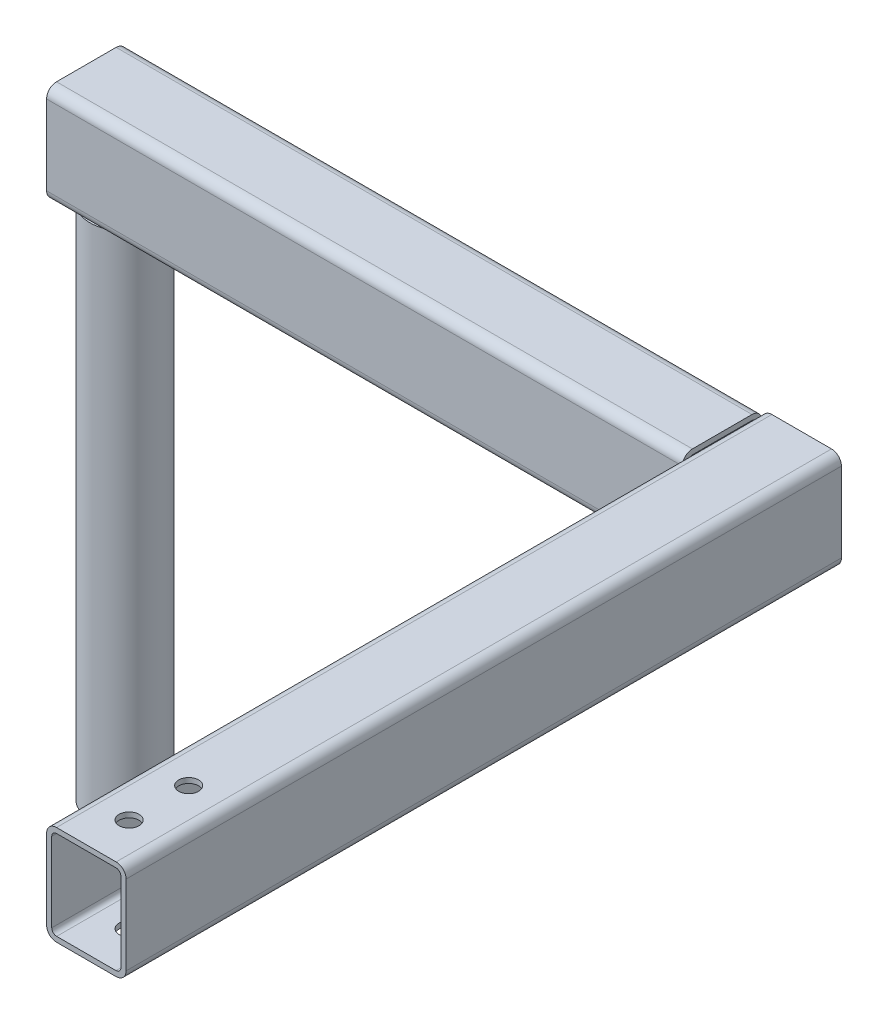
ISO-10303-21;
HEADER;
FILE_DESCRIPTION(('STEP AP214'),'2;1');
FILE_NAME('part.step','',(''),(''),'','','');
FILE_SCHEMA(('AUTOMOTIVE_DESIGN { 1 0 10303 214 1 1 1 1 }'));
ENDSEC;
DATA;
#1=APPLICATION_CONTEXT('core data for automotive mechanical design processes');
#2=APPLICATION_PROTOCOL_DEFINITION('international standard','automotive_design',2000,#1);
#3=PRODUCT_CONTEXT('',#1,'mechanical');
#4=PRODUCT('Part','Part','',(#3));
#5=PRODUCT_RELATED_PRODUCT_CATEGORY('part','',(#4));
#6=PRODUCT_DEFINITION_FORMATION('','',#4);
#7=PRODUCT_DEFINITION_CONTEXT('part definition',#1,'design');
#8=PRODUCT_DEFINITION('design','',#6,#7);
#9=PRODUCT_DEFINITION_SHAPE('','',#8);
#10=(LENGTH_UNIT() NAMED_UNIT(*) SI_UNIT(.MILLI.,.METRE.));
#11=(NAMED_UNIT(*) PLANE_ANGLE_UNIT() SI_UNIT($,.RADIAN.));
#12=(NAMED_UNIT(*) SI_UNIT($,.STERADIAN.) SOLID_ANGLE_UNIT());
#13=UNCERTAINTY_MEASURE_WITH_UNIT(LENGTH_MEASURE(1.E-05),#10,'distance_accuracy_value','');
#14=(GEOMETRIC_REPRESENTATION_CONTEXT(3) GLOBAL_UNCERTAINTY_ASSIGNED_CONTEXT((#13)) GLOBAL_UNIT_ASSIGNED_CONTEXT((#10,
#11,#12)) REPRESENTATION_CONTEXT('',''));
#15=CARTESIAN_POINT('',(0.,0.,0.));
#16=DIRECTION('',(0.,0.,1.));
#17=DIRECTION('',(1.,0.,0.));
#18=AXIS2_PLACEMENT_3D('',#15,#16,#17);
#19=CARTESIAN_POINT('',(-203.2,-180.975,13.0565478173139));
#20=DIRECTION('',(0.,-1.,0.));
#21=DIRECTION('',(0.,0.,-1.));
#22=AXIS2_PLACEMENT_3D('',#19,#20,#21);
#23=PLANE('',#22);
#24=CARTESIAN_POINT('',(-203.2,-180.975,13.0565478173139));
#25=DIRECTION('',(0.,-1.,0.));
#26=DIRECTION('',(0.,0.,-1.));
#27=AXIS2_PLACEMENT_3D('',#24,#25,#26);
#28=CIRCLE('',#27,11.1125);
#29=CARTESIAN_POINT('',(-203.2,-180.975,1.94404781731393));
#30=VERTEX_POINT('',#29);
#31=EDGE_CURVE('E12',#30,#30,#28,.T.);
#32=ORIENTED_EDGE('',*,*,#31,.T.);
#33=EDGE_LOOP('',(#32));
#34=FACE_BOUND('',#33,.T.);
#35=CARTESIAN_POINT('',(-203.2,-180.975,13.0565478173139));
#36=DIRECTION('',(0.,-1.,0.));
#37=DIRECTION('',(1.,0.,0.));
#38=AXIS2_PLACEMENT_3D('',#35,#36,#37);
#39=CIRCLE('',#38,9.46150000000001);
#40=CARTESIAN_POINT('',(-193.7385,-180.975,13.0565478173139));
#41=VERTEX_POINT('',#40);
#42=EDGE_CURVE('E106',#41,#41,#39,.T.);
#43=ORIENTED_EDGE('',*,*,#42,.F.);
#44=EDGE_LOOP('',(#43));
#45=FACE_BOUND('',#44,.T.);
#46=ADVANCED_FACE('F95',(#34,#45),#23,.T.);
#47=CARTESIAN_POINT('',(-203.2,-15.875,13.0565478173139));
#48=DIRECTION('',(0.,-1.,0.));
#49=DIRECTION('',(0.,0.,-1.));
#50=AXIS2_PLACEMENT_3D('',#47,#48,#49);
#51=PLANE('',#50);
#52=CARTESIAN_POINT('',(-203.2,-15.875,13.0565478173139));
#53=DIRECTION('',(0.,-1.,0.));
#54=DIRECTION('',(0.,0.,-1.));
#55=AXIS2_PLACEMENT_3D('',#52,#53,#54);
#56=CIRCLE('',#55,11.1125);
#57=CARTESIAN_POINT('',(-203.2,-15.875,1.94404781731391));
#58=VERTEX_POINT('',#57);
#59=EDGE_CURVE('E99',#58,#58,#56,.T.);
#60=ORIENTED_EDGE('',*,*,#59,.F.);
#61=EDGE_LOOP('',(#60));
#62=FACE_BOUND('',#61,.T.);
#63=CARTESIAN_POINT('',(-203.2,-15.875,13.0565478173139));
#64=DIRECTION('',(0.,-1.,0.));
#65=DIRECTION('',(1.,0.,0.));
#66=AXIS2_PLACEMENT_3D('',#63,#64,#65);
#67=CIRCLE('',#66,9.46150000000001);
#68=CARTESIAN_POINT('',(-193.7385,-15.875,13.0565478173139));
#69=VERTEX_POINT('',#68);
#70=EDGE_CURVE('E108',#69,#69,#67,.T.);
#71=ORIENTED_EDGE('',*,*,#70,.T.);
#72=EDGE_LOOP('',(#71));
#73=FACE_BOUND('',#72,.T.);
#74=ADVANCED_FACE('F118',(#62,#73),#51,.F.);
#75=CARTESIAN_POINT('',(-203.2,-180.975,13.0565478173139));
#76=DIRECTION('',(0.,1.,0.));
#77=DIRECTION('',(0.,0.,1.));
#78=AXIS2_PLACEMENT_3D('',#75,#76,#77);
#79=CYLINDRICAL_SURFACE('',#78,11.1125);
#80=ORIENTED_EDGE('',*,*,#31,.F.);
#81=EDGE_LOOP('',(#80));
#82=FACE_BOUND('',#81,.T.);
#83=ORIENTED_EDGE('',*,*,#59,.T.);
#84=EDGE_LOOP('',(#83));
#85=FACE_BOUND('',#84,.T.);
#86=ADVANCED_FACE('F97',(#82,#85),#79,.T.);
#87=CARTESIAN_POINT('',(-203.2,-180.975,13.0565478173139));
#88=DIRECTION('',(0.,1.,0.));
#89=DIRECTION('',(0.,0.,1.));
#90=AXIS2_PLACEMENT_3D('',#87,#88,#89);
#91=CYLINDRICAL_SURFACE('',#90,9.46150000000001);
#92=ORIENTED_EDGE('',*,*,#42,.T.);
#93=EDGE_LOOP('',(#92));
#94=FACE_BOUND('',#93,.T.);
#95=ORIENTED_EDGE('',*,*,#70,.F.);
#96=EDGE_LOOP('',(#95));
#97=FACE_BOUND('',#96,.T.);
#98=ADVANCED_FACE('F114',(#94,#97),#91,.F.);
#99=CLOSED_SHELL('',(#46,#74,#86,#98));
#100=MANIFOLD_SOLID_BREP('B2',#99);
#101=CARTESIAN_POINT('',(-215.9,15.875,0.));
#102=DIRECTION('',(0.,0.,-1.));
#103=DIRECTION('',(0.,1.,0.));
#104=AXIS2_PLACEMENT_3D('',#101,#102,#103);
#105=PLANE('',#104);
#106=DIRECTION('',(0.,1.,0.));
#107=VECTOR('',#106,1.);
#108=CARTESIAN_POINT('',(-215.9,15.875,0.));
#109=LINE('',#108,#107);
#110=CARTESIAN_POINT('',(-215.9,-12.7,0.));
#111=VERTEX_POINT('',#110);
#112=CARTESIAN_POINT('',(-215.9,12.7,0.));
#113=VERTEX_POINT('',#112);
#114=EDGE_CURVE('E401',#111,#113,#109,.T.);
#115=ORIENTED_EDGE('',*,*,#114,.T.);
#116=DIRECTION('',(1.,0.,0.));
#117=VECTOR('',#116,1.);
#118=CARTESIAN_POINT('',(-215.9,12.7,0.));
#119=LINE('',#118,#117);
#120=CARTESIAN_POINT('',(-12.7,12.7,0.));
#121=VERTEX_POINT('',#120);
#122=EDGE_CURVE('E297',#113,#121,#119,.T.);
#123=ORIENTED_EDGE('',*,*,#122,.T.);
#124=DIRECTION('',(0.,1.,0.));
#125=VECTOR('',#124,1.);
#126=CARTESIAN_POINT('',(-12.7,15.875,0.));
#127=LINE('',#126,#125);
#128=CARTESIAN_POINT('',(-12.7,-12.7,0.));
#129=VERTEX_POINT('',#128);
#130=EDGE_CURVE('E281',#129,#121,#127,.T.);
#131=ORIENTED_EDGE('',*,*,#130,.F.);
#132=DIRECTION('',(1.,0.,0.));
#133=VECTOR('',#132,1.);
#134=CARTESIAN_POINT('',(-215.9,-12.7,0.));
#135=LINE('',#134,#133);
#136=EDGE_CURVE('E294',#129,#111,#135,.F.);
#137=ORIENTED_EDGE('',*,*,#136,.T.);
#138=EDGE_LOOP('',(#115,#123,#131,#137));
#139=FACE_BOUND('',#138,.T.);
#140=ADVANCED_FACE('F165',(#139),#105,.T.);
#141=CARTESIAN_POINT('',(-215.9,-15.875,25.4));
#142=DIRECTION('',(0.,-1.,0.));
#143=DIRECTION('',(0.,0.,-1.));
#144=AXIS2_PLACEMENT_3D('',#141,#142,#143);
#145=PLANE('',#144);
#146=DIRECTION('',(0.,0.,-1.));
#147=VECTOR('',#146,1.);
#148=CARTESIAN_POINT('',(-215.9,-15.875,25.4));
#149=LINE('',#148,#147);
#150=CARTESIAN_POINT('',(-215.9,-15.875,22.225));
#151=VERTEX_POINT('',#150);
#152=CARTESIAN_POINT('',(-215.9,-15.875,3.175));
#153=VERTEX_POINT('',#152);
#154=EDGE_CURVE('E304',#151,#153,#149,.T.);
#155=ORIENTED_EDGE('',*,*,#154,.T.);
#156=DIRECTION('',(1.,0.,0.));
#157=VECTOR('',#156,1.);
#158=CARTESIAN_POINT('',(-215.9,-15.875,3.175));
#159=LINE('',#158,#157);
#160=CARTESIAN_POINT('',(-12.7,-15.875,3.175));
#161=VERTEX_POINT('',#160);
#162=EDGE_CURVE('E331',#153,#161,#159,.T.);
#163=ORIENTED_EDGE('',*,*,#162,.T.);
#164=DIRECTION('',(0.,0.,-1.));
#165=VECTOR('',#164,1.);
#166=CARTESIAN_POINT('',(-12.7,-15.875,25.4));
#167=LINE('',#166,#165);
#168=CARTESIAN_POINT('',(-12.7,-15.875,22.225));
#169=VERTEX_POINT('',#168);
#170=EDGE_CURVE('E283',#169,#161,#167,.T.);
#171=ORIENTED_EDGE('',*,*,#170,.F.);
#172=DIRECTION('',(1.,0.,0.));
#173=VECTOR('',#172,1.);
#174=CARTESIAN_POINT('',(-215.9,-15.875,22.225));
#175=LINE('',#174,#173);
#176=EDGE_CURVE('E329',#169,#151,#175,.F.);
#177=ORIENTED_EDGE('',*,*,#176,.T.);
#178=EDGE_LOOP('',(#155,#163,#171,#177));
#179=FACE_BOUND('',#178,.T.);
#180=ADVANCED_FACE('F434',(#179),#145,.T.);
#181=CARTESIAN_POINT('',(-215.9,15.875,25.4));
#182=DIRECTION('',(0.,0.,1.));
#183=DIRECTION('',(0.,-1.,0.));
#184=AXIS2_PLACEMENT_3D('',#181,#182,#183);
#185=PLANE('',#184);
#186=DIRECTION('',(0.,-1.,0.));
#187=VECTOR('',#186,1.);
#188=CARTESIAN_POINT('',(-215.9,15.875,25.4));
#189=LINE('',#188,#187);
#190=CARTESIAN_POINT('',(-215.9,12.7,25.4));
#191=VERTEX_POINT('',#190);
#192=CARTESIAN_POINT('',(-215.9,-12.7,25.4));
#193=VERTEX_POINT('',#192);
#194=EDGE_CURVE('E309',#191,#193,#189,.T.);
#195=ORIENTED_EDGE('',*,*,#194,.T.);
#196=DIRECTION('',(1.,0.,0.));
#197=VECTOR('',#196,1.);
#198=CARTESIAN_POINT('',(-215.9,-12.7,25.4));
#199=LINE('',#198,#197);
#200=CARTESIAN_POINT('',(-12.7,-12.7,25.4));
#201=VERTEX_POINT('',#200);
#202=EDGE_CURVE('E335',#193,#201,#199,.T.);
#203=ORIENTED_EDGE('',*,*,#202,.T.);
#204=DIRECTION('',(0.,-1.,0.));
#205=VECTOR('',#204,1.);
#206=CARTESIAN_POINT('',(-12.7,15.875,25.4));
#207=LINE('',#206,#205);
#208=CARTESIAN_POINT('',(-12.7,12.7,25.4));
#209=VERTEX_POINT('',#208);
#210=EDGE_CURVE('E409',#209,#201,#207,.T.);
#211=ORIENTED_EDGE('',*,*,#210,.F.);
#212=DIRECTION('',(1.,0.,0.));
#213=VECTOR('',#212,1.);
#214=CARTESIAN_POINT('',(-215.9,12.7,25.4));
#215=LINE('',#214,#213);
#216=EDGE_CURVE('E333',#209,#191,#215,.F.);
#217=ORIENTED_EDGE('',*,*,#216,.T.);
#218=EDGE_LOOP('',(#195,#203,#211,#217));
#219=FACE_BOUND('',#218,.T.);
#220=ADVANCED_FACE('F414',(#219),#185,.T.);
#221=CARTESIAN_POINT('',(-215.9,15.875,25.4));
#222=DIRECTION('',(0.,1.,0.));
#223=DIRECTION('',(0.,0.,1.));
#224=AXIS2_PLACEMENT_3D('',#221,#222,#223);
#225=PLANE('',#224);
#226=DIRECTION('',(0.,0.,1.));
#227=VECTOR('',#226,1.);
#228=CARTESIAN_POINT('',(-12.7,15.875,25.4));
#229=LINE('',#228,#227);
#230=CARTESIAN_POINT('',(-12.7,15.875,3.175));
#231=VERTEX_POINT('',#230);
#232=CARTESIAN_POINT('',(-12.7,15.875,22.225));
#233=VERTEX_POINT('',#232);
#234=EDGE_CURVE('E298',#231,#233,#229,.T.);
#235=ORIENTED_EDGE('',*,*,#234,.F.);
#236=DIRECTION('',(1.,0.,0.));
#237=VECTOR('',#236,1.);
#238=CARTESIAN_POINT('',(-215.9,15.875,3.175));
#239=LINE('',#238,#237);
#240=CARTESIAN_POINT('',(-215.9,15.875,3.175));
#241=VERTEX_POINT('',#240);
#242=EDGE_CURVE('E320',#231,#241,#239,.F.);
#243=ORIENTED_EDGE('',*,*,#242,.T.);
#244=DIRECTION('',(0.,0.,1.));
#245=VECTOR('',#244,1.);
#246=CARTESIAN_POINT('',(-215.9,15.875,25.4));
#247=LINE('',#246,#245);
#248=CARTESIAN_POINT('',(-215.9,15.875,22.225));
#249=VERTEX_POINT('',#248);
#250=EDGE_CURVE('E403',#241,#249,#247,.T.);
#251=ORIENTED_EDGE('',*,*,#250,.T.);
#252=DIRECTION('',(1.,0.,0.));
#253=VECTOR('',#252,1.);
#254=CARTESIAN_POINT('',(-215.9,15.875,22.225));
#255=LINE('',#254,#253);
#256=EDGE_CURVE('E317',#249,#233,#255,.T.);
#257=ORIENTED_EDGE('',*,*,#256,.T.);
#258=EDGE_LOOP('',(#235,#243,#251,#257));
#259=FACE_BOUND('',#258,.T.);
#260=ADVANCED_FACE('F427',(#259),#225,.T.);
#261=CARTESIAN_POINT('',(-215.9,0.,0.));
#262=DIRECTION('',(1.,0.,0.));
#263=DIRECTION('',(0.,0.,-1.));
#264=AXIS2_PLACEMENT_3D('',#261,#262,#263);
#265=PLANE('',#264);
#266=DIRECTION('',(0.,-1.,0.));
#267=VECTOR('',#266,1.);
#268=CARTESIAN_POINT('',(-215.9,15.875,23.749));
#269=LINE('',#268,#267);
#270=CARTESIAN_POINT('',(-215.9,12.573,23.749));
#271=VERTEX_POINT('',#270);
#272=CARTESIAN_POINT('',(-215.9,-12.573,23.749));
#273=VERTEX_POINT('',#272);
#274=EDGE_CURVE('E385',#271,#273,#269,.T.);
#275=ORIENTED_EDGE('',*,*,#274,.T.);
#276=CARTESIAN_POINT('',(-215.9,-12.573,22.098));
#277=DIRECTION('',(1.,0.,0.));
#278=DIRECTION('',(0.,0.,-1.));
#279=AXIS2_PLACEMENT_3D('',#276,#277,#278);
#280=CIRCLE('',#279,1.651);
#281=CARTESIAN_POINT('',(-215.9,-14.224,22.098));
#282=VERTEX_POINT('',#281);
#283=EDGE_CURVE('E363',#273,#282,#280,.T.);
#284=ORIENTED_EDGE('',*,*,#283,.T.);
#285=DIRECTION('',(0.,0.,-1.));
#286=VECTOR('',#285,1.);
#287=CARTESIAN_POINT('',(-215.9,-14.224,25.4));
#288=LINE('',#287,#286);
#289=CARTESIAN_POINT('',(-215.9,-14.224,3.302));
#290=VERTEX_POINT('',#289);
#291=EDGE_CURVE('E299',#282,#290,#288,.T.);
#292=ORIENTED_EDGE('',*,*,#291,.T.);
#293=CARTESIAN_POINT('',(-215.9,-12.573,3.302));
#294=DIRECTION('',(1.,0.,0.));
#295=DIRECTION('',(0.,0.,-1.));
#296=AXIS2_PLACEMENT_3D('',#293,#294,#295);
#297=CIRCLE('',#296,1.651);
#298=CARTESIAN_POINT('',(-215.9,-12.573,1.651));
#299=VERTEX_POINT('',#298);
#300=EDGE_CURVE('E359',#290,#299,#297,.T.);
#301=ORIENTED_EDGE('',*,*,#300,.T.);
#302=DIRECTION('',(0.,1.,0.));
#303=VECTOR('',#302,1.);
#304=CARTESIAN_POINT('',(-215.9,15.875,1.651));
#305=LINE('',#304,#303);
#306=CARTESIAN_POINT('',(-215.9,12.573,1.651));
#307=VERTEX_POINT('',#306);
#308=EDGE_CURVE('E386',#299,#307,#305,.T.);
#309=ORIENTED_EDGE('',*,*,#308,.T.);
#310=CARTESIAN_POINT('',(-215.9,12.573,3.302));
#311=DIRECTION('',(1.,0.,0.));
#312=DIRECTION('',(0.,0.,-1.));
#313=AXIS2_PLACEMENT_3D('',#310,#311,#312);
#314=CIRCLE('',#313,1.651);
#315=CARTESIAN_POINT('',(-215.9,14.224,3.302));
#316=VERTEX_POINT('',#315);
#317=EDGE_CURVE('E93',#307,#316,#314,.T.);
#318=ORIENTED_EDGE('',*,*,#317,.T.);
#319=DIRECTION('',(0.,0.,1.));
#320=VECTOR('',#319,1.);
#321=CARTESIAN_POINT('',(-215.9,14.224,25.4));
#322=LINE('',#321,#320);
#323=CARTESIAN_POINT('',(-215.9,14.224,22.098));
#324=VERTEX_POINT('',#323);
#325=EDGE_CURVE('E383',#316,#324,#322,.T.);
#326=ORIENTED_EDGE('',*,*,#325,.T.);
#327=CARTESIAN_POINT('',(-215.9,12.573,22.098));
#328=DIRECTION('',(1.,0.,0.));
#329=DIRECTION('',(0.,0.,-1.));
#330=AXIS2_PLACEMENT_3D('',#327,#328,#329);
#331=CIRCLE('',#330,1.651);
#332=EDGE_CURVE('E367',#324,#271,#331,.T.);
#333=ORIENTED_EDGE('',*,*,#332,.T.);
#334=EDGE_LOOP('',(#275,#284,#292,#301,#309,#318,#326,#333));
#335=FACE_BOUND('',#334,.T.);
#336=ORIENTED_EDGE('',*,*,#250,.F.);
#337=CARTESIAN_POINT('',(-215.9,12.7,3.175));
#338=DIRECTION('',(1.,0.,0.));
#339=DIRECTION('',(0.,0.,-1.));
#340=AXIS2_PLACEMENT_3D('',#337,#338,#339);
#341=CIRCLE('',#340,3.175);
#342=EDGE_CURVE('E327',#241,#113,#341,.F.);
#343=ORIENTED_EDGE('',*,*,#342,.T.);
#344=ORIENTED_EDGE('',*,*,#114,.F.);
#345=CARTESIAN_POINT('',(-215.9,-12.7,3.175));
#346=DIRECTION('',(1.,0.,0.));
#347=DIRECTION('',(0.,0.,-1.));
#348=AXIS2_PLACEMENT_3D('',#345,#346,#347);
#349=CIRCLE('',#348,3.175);
#350=EDGE_CURVE('E303',#111,#153,#349,.F.);
#351=ORIENTED_EDGE('',*,*,#350,.T.);
#352=ORIENTED_EDGE('',*,*,#154,.F.);
#353=CARTESIAN_POINT('',(-215.9,-12.7,22.225));
#354=DIRECTION('',(1.,0.,0.));
#355=DIRECTION('',(0.,0.,-1.));
#356=AXIS2_PLACEMENT_3D('',#353,#354,#355);
#357=CIRCLE('',#356,3.175);
#358=EDGE_CURVE('E324',#151,#193,#357,.F.);
#359=ORIENTED_EDGE('',*,*,#358,.T.);
#360=ORIENTED_EDGE('',*,*,#194,.F.);
#361=CARTESIAN_POINT('',(-215.9,12.7,22.225));
#362=DIRECTION('',(1.,0.,0.));
#363=DIRECTION('',(0.,0.,-1.));
#364=AXIS2_PLACEMENT_3D('',#361,#362,#363);
#365=CIRCLE('',#364,3.175);
#366=EDGE_CURVE('E322',#191,#249,#365,.F.);
#367=ORIENTED_EDGE('',*,*,#366,.T.);
#368=EDGE_LOOP('',(#336,#343,#344,#351,#352,#359,#360,#367));
#369=FACE_BOUND('',#368,.T.);
#370=ADVANCED_FACE('F423',(#335,#369),#265,.F.);
#371=CARTESIAN_POINT('',(-12.7,0.,0.));
#372=DIRECTION('',(1.,0.,0.));
#373=DIRECTION('',(0.,0.,-1.));
#374=AXIS2_PLACEMENT_3D('',#371,#372,#373);
#375=PLANE('',#374);
#376=DIRECTION('',(0.,1.,0.));
#377=VECTOR('',#376,1.);
#378=CARTESIAN_POINT('',(-12.7,15.875,1.651));
#379=LINE('',#378,#377);
#380=CARTESIAN_POINT('',(-12.7,-12.573,1.651));
#381=VERTEX_POINT('',#380);
#382=CARTESIAN_POINT('',(-12.7,12.573,1.651));
#383=VERTEX_POINT('',#382);
#384=EDGE_CURVE('E372',#381,#383,#379,.T.);
#385=ORIENTED_EDGE('',*,*,#384,.F.);
#386=CARTESIAN_POINT('',(-12.7,-12.573,3.302));
#387=DIRECTION('',(1.,0.,0.));
#388=DIRECTION('',(0.,0.,-1.));
#389=AXIS2_PLACEMENT_3D('',#386,#387,#388);
#390=CIRCLE('',#389,1.651);
#391=CARTESIAN_POINT('',(-12.7,-14.224,3.302));
#392=VERTEX_POINT('',#391);
#393=EDGE_CURVE('E357',#381,#392,#390,.F.);
#394=ORIENTED_EDGE('',*,*,#393,.T.);
#395=DIRECTION('',(0.,0.,-1.));
#396=VECTOR('',#395,1.);
#397=CARTESIAN_POINT('',(-12.7,-14.224,25.4));
#398=LINE('',#397,#396);
#399=CARTESIAN_POINT('',(-12.7,-14.224,22.098));
#400=VERTEX_POINT('',#399);
#401=EDGE_CURVE('E390',#400,#392,#398,.T.);
#402=ORIENTED_EDGE('',*,*,#401,.F.);
#403=CARTESIAN_POINT('',(-12.7,-12.573,22.098));
#404=DIRECTION('',(1.,0.,0.));
#405=DIRECTION('',(0.,0.,-1.));
#406=AXIS2_PLACEMENT_3D('',#403,#404,#405);
#407=CIRCLE('',#406,1.651);
#408=CARTESIAN_POINT('',(-12.7,-12.573,23.749));
#409=VERTEX_POINT('',#408);
#410=EDGE_CURVE('E361',#400,#409,#407,.F.);
#411=ORIENTED_EDGE('',*,*,#410,.T.);
#412=DIRECTION('',(0.,-1.,0.));
#413=VECTOR('',#412,1.);
#414=CARTESIAN_POINT('',(-12.7,15.875,23.749));
#415=LINE('',#414,#413);
#416=CARTESIAN_POINT('',(-12.7,12.573,23.749));
#417=VERTEX_POINT('',#416);
#418=EDGE_CURVE('E396',#417,#409,#415,.T.);
#419=ORIENTED_EDGE('',*,*,#418,.F.);
#420=CARTESIAN_POINT('',(-12.7,12.573,22.098));
#421=DIRECTION('',(1.,0.,0.));
#422=DIRECTION('',(0.,0.,-1.));
#423=AXIS2_PLACEMENT_3D('',#420,#421,#422);
#424=CIRCLE('',#423,1.651);
#425=CARTESIAN_POINT('',(-12.7,14.224,22.098));
#426=VERTEX_POINT('',#425);
#427=EDGE_CURVE('E365',#417,#426,#424,.F.);
#428=ORIENTED_EDGE('',*,*,#427,.T.);
#429=DIRECTION('',(0.,0.,1.));
#430=VECTOR('',#429,1.);
#431=CARTESIAN_POINT('',(-12.7,14.224,25.4));
#432=LINE('',#431,#430);
#433=CARTESIAN_POINT('',(-12.7,14.224,3.302));
#434=VERTEX_POINT('',#433);
#435=EDGE_CURVE('E373',#434,#426,#432,.T.);
#436=ORIENTED_EDGE('',*,*,#435,.F.);
#437=CARTESIAN_POINT('',(-12.7,12.573,3.302));
#438=DIRECTION('',(1.,0.,0.));
#439=DIRECTION('',(0.,0.,-1.));
#440=AXIS2_PLACEMENT_3D('',#437,#438,#439);
#441=CIRCLE('',#440,1.651);
#442=EDGE_CURVE('E173',#434,#383,#441,.F.);
#443=ORIENTED_EDGE('',*,*,#442,.T.);
#444=EDGE_LOOP('',(#385,#394,#402,#411,#419,#428,#436,#443));
#445=FACE_BOUND('',#444,.T.);
#446=ORIENTED_EDGE('',*,*,#130,.T.);
#447=CARTESIAN_POINT('',(-12.7,12.7,3.175));
#448=DIRECTION('',(1.,0.,0.));
#449=DIRECTION('',(0.,0.,-1.));
#450=AXIS2_PLACEMENT_3D('',#447,#448,#449);
#451=CIRCLE('',#450,3.175);
#452=EDGE_CURVE('E288',#121,#231,#451,.T.);
#453=ORIENTED_EDGE('',*,*,#452,.T.);
#454=ORIENTED_EDGE('',*,*,#234,.T.);
#455=CARTESIAN_POINT('',(-12.7,12.7,22.225));
#456=DIRECTION('',(1.,0.,0.));
#457=DIRECTION('',(0.,0.,-1.));
#458=AXIS2_PLACEMENT_3D('',#455,#456,#457);
#459=CIRCLE('',#458,3.175);
#460=EDGE_CURVE('E306',#233,#209,#459,.T.);
#461=ORIENTED_EDGE('',*,*,#460,.T.);
#462=ORIENTED_EDGE('',*,*,#210,.T.);
#463=CARTESIAN_POINT('',(-12.7,-12.7,22.225));
#464=DIRECTION('',(1.,0.,0.));
#465=DIRECTION('',(0.,0.,-1.));
#466=AXIS2_PLACEMENT_3D('',#463,#464,#465);
#467=CIRCLE('',#466,3.175);
#468=EDGE_CURVE('E289',#201,#169,#467,.T.);
#469=ORIENTED_EDGE('',*,*,#468,.T.);
#470=ORIENTED_EDGE('',*,*,#170,.T.);
#471=CARTESIAN_POINT('',(-12.7,-12.7,3.175));
#472=DIRECTION('',(1.,0.,0.));
#473=DIRECTION('',(0.,0.,-1.));
#474=AXIS2_PLACEMENT_3D('',#471,#472,#473);
#475=CIRCLE('',#474,3.175);
#476=EDGE_CURVE('E278',#161,#129,#475,.T.);
#477=ORIENTED_EDGE('',*,*,#476,.T.);
#478=EDGE_LOOP('',(#446,#453,#454,#461,#462,#469,#470,#477));
#479=FACE_BOUND('',#478,.T.);
#480=ADVANCED_FACE('F280',(#445,#479),#375,.T.);
#481=CARTESIAN_POINT('',(-215.9,15.875,1.651));
#482=DIRECTION('',(0.,0.,-1.));
#483=DIRECTION('',(0.,1.,0.));
#484=AXIS2_PLACEMENT_3D('',#481,#482,#483);
#485=PLANE('',#484);
#486=ORIENTED_EDGE('',*,*,#308,.F.);
#487=DIRECTION('',(1.,0.,0.));
#488=VECTOR('',#487,1.);
#489=CARTESIAN_POINT('',(-12.7,-12.573,1.651));
#490=LINE('',#489,#488);
#491=EDGE_CURVE('E340',#299,#381,#490,.T.);
#492=ORIENTED_EDGE('',*,*,#491,.T.);
#493=ORIENTED_EDGE('',*,*,#384,.T.);
#494=DIRECTION('',(1.,0.,0.));
#495=VECTOR('',#494,1.);
#496=CARTESIAN_POINT('',(-215.9,12.573,1.651));
#497=LINE('',#496,#495);
#498=EDGE_CURVE('E338',#383,#307,#497,.F.);
#499=ORIENTED_EDGE('',*,*,#498,.T.);
#500=EDGE_LOOP('',(#486,#492,#493,#499));
#501=FACE_BOUND('',#500,.T.);
#502=ADVANCED_FACE('F379',(#501),#485,.F.);
#503=CARTESIAN_POINT('',(-215.9,-14.224,25.4));
#504=DIRECTION('',(0.,-1.,0.));
#505=DIRECTION('',(0.,0.,-1.));
#506=AXIS2_PLACEMENT_3D('',#503,#504,#505);
#507=PLANE('',#506);
#508=ORIENTED_EDGE('',*,*,#401,.T.);
#509=DIRECTION('',(1.,0.,0.));
#510=VECTOR('',#509,1.);
#511=CARTESIAN_POINT('',(-215.9,-14.224,3.302));
#512=LINE('',#511,#510);
#513=EDGE_CURVE('E346',#392,#290,#512,.F.);
#514=ORIENTED_EDGE('',*,*,#513,.T.);
#515=ORIENTED_EDGE('',*,*,#291,.F.);
#516=DIRECTION('',(1.,0.,0.));
#517=VECTOR('',#516,1.);
#518=CARTESIAN_POINT('',(-12.7,-14.224,22.098));
#519=LINE('',#518,#517);
#520=EDGE_CURVE('E343',#282,#400,#519,.T.);
#521=ORIENTED_EDGE('',*,*,#520,.T.);
#522=EDGE_LOOP('',(#508,#514,#515,#521));
#523=FACE_BOUND('',#522,.T.);
#524=ADVANCED_FACE('F465',(#523),#507,.F.);
#525=CARTESIAN_POINT('',(-215.9,15.875,23.749));
#526=DIRECTION('',(0.,0.,1.));
#527=DIRECTION('',(0.,-1.,0.));
#528=AXIS2_PLACEMENT_3D('',#525,#526,#527);
#529=PLANE('',#528);
#530=ORIENTED_EDGE('',*,*,#418,.T.);
#531=DIRECTION('',(1.,0.,0.));
#532=VECTOR('',#531,1.);
#533=CARTESIAN_POINT('',(-215.9,-12.573,23.749));
#534=LINE('',#533,#532);
#535=EDGE_CURVE('E351',#409,#273,#534,.F.);
#536=ORIENTED_EDGE('',*,*,#535,.T.);
#537=ORIENTED_EDGE('',*,*,#274,.F.);
#538=DIRECTION('',(1.,0.,0.));
#539=VECTOR('',#538,1.);
#540=CARTESIAN_POINT('',(-12.7,12.573,23.749));
#541=LINE('',#540,#539);
#542=EDGE_CURVE('E348',#271,#417,#541,.T.);
#543=ORIENTED_EDGE('',*,*,#542,.T.);
#544=EDGE_LOOP('',(#530,#536,#537,#543));
#545=FACE_BOUND('',#544,.T.);
#546=ADVANCED_FACE('F460',(#545),#529,.F.);
#547=CARTESIAN_POINT('',(-215.9,14.224,25.4));
#548=DIRECTION('',(0.,1.,0.));
#549=DIRECTION('',(0.,0.,1.));
#550=AXIS2_PLACEMENT_3D('',#547,#548,#549);
#551=PLANE('',#550);
#552=ORIENTED_EDGE('',*,*,#435,.T.);
#553=DIRECTION('',(1.,0.,0.));
#554=VECTOR('',#553,1.);
#555=CARTESIAN_POINT('',(-215.9,14.224,22.098));
#556=LINE('',#555,#554);
#557=EDGE_CURVE('E180',#426,#324,#556,.F.);
#558=ORIENTED_EDGE('',*,*,#557,.T.);
#559=ORIENTED_EDGE('',*,*,#325,.F.);
#560=DIRECTION('',(1.,0.,0.));
#561=VECTOR('',#560,1.);
#562=CARTESIAN_POINT('',(-12.7,14.224,3.302));
#563=LINE('',#562,#561);
#564=EDGE_CURVE('E353',#316,#434,#563,.T.);
#565=ORIENTED_EDGE('',*,*,#564,.T.);
#566=EDGE_LOOP('',(#552,#558,#559,#565));
#567=FACE_BOUND('',#566,.T.);
#568=ADVANCED_FACE('F382',(#567),#551,.F.);
#569=CARTESIAN_POINT('',(-215.9,12.7,3.175));
#570=DIRECTION('',(1.,0.,0.));
#571=DIRECTION('',(0.,0.,-1.));
#572=AXIS2_PLACEMENT_3D('',#569,#570,#571);
#573=CYLINDRICAL_SURFACE('',#572,3.175);
#574=ORIENTED_EDGE('',*,*,#342,.F.);
#575=ORIENTED_EDGE('',*,*,#242,.F.);
#576=ORIENTED_EDGE('',*,*,#452,.F.);
#577=ORIENTED_EDGE('',*,*,#122,.F.);
#578=EDGE_LOOP('',(#574,#575,#576,#577));
#579=FACE_BOUND('',#578,.T.);
#580=ADVANCED_FACE('F430',(#579),#573,.T.);
#581=CARTESIAN_POINT('',(-215.9,-12.7,3.175));
#582=DIRECTION('',(1.,0.,0.));
#583=DIRECTION('',(0.,0.,-1.));
#584=AXIS2_PLACEMENT_3D('',#581,#582,#583);
#585=CYLINDRICAL_SURFACE('',#584,3.175);
#586=ORIENTED_EDGE('',*,*,#350,.F.);
#587=ORIENTED_EDGE('',*,*,#136,.F.);
#588=ORIENTED_EDGE('',*,*,#476,.F.);
#589=ORIENTED_EDGE('',*,*,#162,.F.);
#590=EDGE_LOOP('',(#586,#587,#588,#589));
#591=FACE_BOUND('',#590,.T.);
#592=ADVANCED_FACE('F302',(#591),#585,.T.);
#593=CARTESIAN_POINT('',(-215.9,-12.7,22.225));
#594=DIRECTION('',(1.,0.,0.));
#595=DIRECTION('',(0.,0.,-1.));
#596=AXIS2_PLACEMENT_3D('',#593,#594,#595);
#597=CYLINDRICAL_SURFACE('',#596,3.175);
#598=ORIENTED_EDGE('',*,*,#358,.F.);
#599=ORIENTED_EDGE('',*,*,#176,.F.);
#600=ORIENTED_EDGE('',*,*,#468,.F.);
#601=ORIENTED_EDGE('',*,*,#202,.F.);
#602=EDGE_LOOP('',(#598,#599,#600,#601));
#603=FACE_BOUND('',#602,.T.);
#604=ADVANCED_FACE('F437',(#603),#597,.T.);
#605=CARTESIAN_POINT('',(-215.9,12.7,22.225));
#606=DIRECTION('',(1.,0.,0.));
#607=DIRECTION('',(0.,0.,-1.));
#608=AXIS2_PLACEMENT_3D('',#605,#606,#607);
#609=CYLINDRICAL_SURFACE('',#608,3.175);
#610=ORIENTED_EDGE('',*,*,#366,.F.);
#611=ORIENTED_EDGE('',*,*,#216,.F.);
#612=ORIENTED_EDGE('',*,*,#460,.F.);
#613=ORIENTED_EDGE('',*,*,#256,.F.);
#614=EDGE_LOOP('',(#610,#611,#612,#613));
#615=FACE_BOUND('',#614,.T.);
#616=ADVANCED_FACE('F419',(#615),#609,.T.);
#617=CARTESIAN_POINT('',(-215.9,-12.573,3.302));
#618=DIRECTION('',(-1.,0.,0.));
#619=DIRECTION('',(0.,0.,1.));
#620=AXIS2_PLACEMENT_3D('',#617,#618,#619);
#621=CYLINDRICAL_SURFACE('',#620,1.651);
#622=ORIENTED_EDGE('',*,*,#300,.F.);
#623=ORIENTED_EDGE('',*,*,#513,.F.);
#624=ORIENTED_EDGE('',*,*,#393,.F.);
#625=ORIENTED_EDGE('',*,*,#491,.F.);
#626=EDGE_LOOP('',(#622,#623,#624,#625));
#627=FACE_BOUND('',#626,.T.);
#628=ADVANCED_FACE('F444',(#627),#621,.F.);
#629=CARTESIAN_POINT('',(-215.9,-12.573,22.098));
#630=DIRECTION('',(-1.,0.,0.));
#631=DIRECTION('',(0.,0.,1.));
#632=AXIS2_PLACEMENT_3D('',#629,#630,#631);
#633=CYLINDRICAL_SURFACE('',#632,1.651);
#634=ORIENTED_EDGE('',*,*,#283,.F.);
#635=ORIENTED_EDGE('',*,*,#535,.F.);
#636=ORIENTED_EDGE('',*,*,#410,.F.);
#637=ORIENTED_EDGE('',*,*,#520,.F.);
#638=EDGE_LOOP('',(#634,#635,#636,#637));
#639=FACE_BOUND('',#638,.T.);
#640=ADVANCED_FACE('F518',(#639),#633,.F.);
#641=CARTESIAN_POINT('',(-215.9,12.573,22.098));
#642=DIRECTION('',(-1.,0.,0.));
#643=DIRECTION('',(0.,0.,1.));
#644=AXIS2_PLACEMENT_3D('',#641,#642,#643);
#645=CYLINDRICAL_SURFACE('',#644,1.651);
#646=ORIENTED_EDGE('',*,*,#332,.F.);
#647=ORIENTED_EDGE('',*,*,#557,.F.);
#648=ORIENTED_EDGE('',*,*,#427,.F.);
#649=ORIENTED_EDGE('',*,*,#542,.F.);
#650=EDGE_LOOP('',(#646,#647,#648,#649));
#651=FACE_BOUND('',#650,.T.);
#652=ADVANCED_FACE('F529',(#651),#645,.F.);
#653=CARTESIAN_POINT('',(-215.9,12.573,3.302));
#654=DIRECTION('',(-1.,0.,0.));
#655=DIRECTION('',(0.,0.,1.));
#656=AXIS2_PLACEMENT_3D('',#653,#654,#655);
#657=CYLINDRICAL_SURFACE('',#656,1.651);
#658=ORIENTED_EDGE('',*,*,#317,.F.);
#659=ORIENTED_EDGE('',*,*,#498,.F.);
#660=ORIENTED_EDGE('',*,*,#442,.F.);
#661=ORIENTED_EDGE('',*,*,#564,.F.);
#662=EDGE_LOOP('',(#658,#659,#660,#661));
#663=FACE_BOUND('',#662,.T.);
#664=ADVANCED_FACE('F167',(#663),#657,.F.);
#665=CLOSED_SHELL('',(#140,#180,#220,#260,#370,#480,#502,#524,#546,#568,#580,#592,#604,#616,
#628,#640,#652,#664));
#666=MANIFOLD_SOLID_BREP('B7',#665);
#667=CARTESIAN_POINT('',(0.,0.,228.6));
#668=DIRECTION('',(0.,0.,1.));
#669=DIRECTION('',(1.,0.,0.));
#670=AXIS2_PLACEMENT_3D('',#667,#668,#669);
#671=PLANE('',#670);
#672=DIRECTION('',(0.,-1.,0.));
#673=VECTOR('',#672,1.);
#674=CARTESIAN_POINT('',(-12.7,15.875,228.6));
#675=LINE('',#674,#673);
#676=CARTESIAN_POINT('',(-12.7,12.7,228.6));
#677=VERTEX_POINT('',#676);
#678=CARTESIAN_POINT('',(-12.7,-12.7,228.6));
#679=VERTEX_POINT('',#678);
#680=EDGE_CURVE('E848',#677,#679,#675,.T.);
#681=ORIENTED_EDGE('',*,*,#680,.T.);
#682=CARTESIAN_POINT('',(-9.525,-12.7,228.6));
#683=DIRECTION('',(0.,0.,1.));
#684=DIRECTION('',(1.,0.,0.));
#685=AXIS2_PLACEMENT_3D('',#682,#683,#684);
#686=CIRCLE('',#685,3.175);
#687=CARTESIAN_POINT('',(-9.525,-15.875,228.6));
#688=VERTEX_POINT('',#687);
#689=EDGE_CURVE('E803',#679,#688,#686,.T.);
#690=ORIENTED_EDGE('',*,*,#689,.T.);
#691=DIRECTION('',(1.,0.,0.));
#692=VECTOR('',#691,1.);
#693=CARTESIAN_POINT('',(12.7,-15.875,228.6));
#694=LINE('',#693,#692);
#695=CARTESIAN_POINT('',(9.525,-15.875,228.6));
#696=VERTEX_POINT('',#695);
#697=EDGE_CURVE('E851',#688,#696,#694,.T.);
#698=ORIENTED_EDGE('',*,*,#697,.T.);
#699=CARTESIAN_POINT('',(9.525,-12.7,228.6));
#700=DIRECTION('',(0.,0.,1.));
#701=DIRECTION('',(1.,0.,0.));
#702=AXIS2_PLACEMENT_3D('',#699,#700,#701);
#703=CIRCLE('',#702,3.175);
#704=CARTESIAN_POINT('',(12.7,-12.7,228.6));
#705=VERTEX_POINT('',#704);
#706=EDGE_CURVE('E801',#696,#705,#703,.T.);
#707=ORIENTED_EDGE('',*,*,#706,.T.);
#708=DIRECTION('',(0.,1.,0.));
#709=VECTOR('',#708,1.);
#710=CARTESIAN_POINT('',(12.7,15.875,228.6));
#711=LINE('',#710,#709);
#712=CARTESIAN_POINT('',(12.7,12.7,228.6));
#713=VERTEX_POINT('',#712);
#714=EDGE_CURVE('E749',#705,#713,#711,.T.);
#715=ORIENTED_EDGE('',*,*,#714,.T.);
#716=CARTESIAN_POINT('',(9.525,12.7,228.6));
#717=DIRECTION('',(0.,0.,1.));
#718=DIRECTION('',(1.,0.,0.));
#719=AXIS2_PLACEMENT_3D('',#716,#717,#718);
#720=CIRCLE('',#719,3.175);
#721=CARTESIAN_POINT('',(9.525,15.875,228.6));
#722=VERTEX_POINT('',#721);
#723=EDGE_CURVE('E626',#713,#722,#720,.T.);
#724=ORIENTED_EDGE('',*,*,#723,.T.);
#725=DIRECTION('',(-1.,0.,0.));
#726=VECTOR('',#725,1.);
#727=CARTESIAN_POINT('',(12.7,15.875,228.6));
#728=LINE('',#727,#726);
#729=CARTESIAN_POINT('',(-9.525,15.875,228.6));
#730=VERTEX_POINT('',#729);
#731=EDGE_CURVE('E745',#722,#730,#728,.T.);
#732=ORIENTED_EDGE('',*,*,#731,.T.);
#733=CARTESIAN_POINT('',(-9.525,12.7,228.6));
#734=DIRECTION('',(0.,0.,1.));
#735=DIRECTION('',(1.,0.,0.));
#736=AXIS2_PLACEMENT_3D('',#733,#734,#735);
#737=CIRCLE('',#736,3.175);
#738=EDGE_CURVE('E798',#730,#677,#737,.T.);
#739=ORIENTED_EDGE('',*,*,#738,.T.);
#740=EDGE_LOOP('',(#681,#690,#698,#707,#715,#724,#732,#739));
#741=FACE_BOUND('',#740,.T.);
#742=DIRECTION('',(1.,0.,0.));
#743=VECTOR('',#742,1.);
#744=CARTESIAN_POINT('',(0.,-14.224,228.6));
#745=LINE('',#744,#743);
#746=CARTESIAN_POINT('',(-9.4742,-14.224,228.6));
#747=VERTEX_POINT('',#746);
#748=CARTESIAN_POINT('',(9.4742,-14.224,228.6));
#749=VERTEX_POINT('',#748);
#750=EDGE_CURVE('E834',#747,#749,#745,.T.);
#751=ORIENTED_EDGE('',*,*,#750,.F.);
#752=CARTESIAN_POINT('',(-9.4742,-12.6492,228.6));
#753=DIRECTION('',(0.,0.,1.));
#754=DIRECTION('',(1.,0.,0.));
#755=AXIS2_PLACEMENT_3D('',#752,#753,#754);
#756=CIRCLE('',#755,1.5748);
#757=CARTESIAN_POINT('',(-11.049,-12.6492,228.6));
#758=VERTEX_POINT('',#757);
#759=EDGE_CURVE('E730',#747,#758,#756,.F.);
#760=ORIENTED_EDGE('',*,*,#759,.T.);
#761=DIRECTION('',(0.,-1.,0.));
#762=VECTOR('',#761,1.);
#763=CARTESIAN_POINT('',(-11.049,0.,228.6));
#764=LINE('',#763,#762);
#765=CARTESIAN_POINT('',(-11.049,12.6492,228.6));
#766=VERTEX_POINT('',#765);
#767=EDGE_CURVE('E831',#766,#758,#764,.T.);
#768=ORIENTED_EDGE('',*,*,#767,.F.);
#769=CARTESIAN_POINT('',(-9.4742,12.6492,228.6));
#770=DIRECTION('',(0.,0.,1.));
#771=DIRECTION('',(1.,0.,0.));
#772=AXIS2_PLACEMENT_3D('',#769,#770,#771);
#773=CIRCLE('',#772,1.5748);
#774=CARTESIAN_POINT('',(-9.4742,14.224,228.6));
#775=VERTEX_POINT('',#774);
#776=EDGE_CURVE('E731',#766,#775,#773,.F.);
#777=ORIENTED_EDGE('',*,*,#776,.T.);
#778=DIRECTION('',(-1.,0.,0.));
#779=VECTOR('',#778,1.);
#780=CARTESIAN_POINT('',(0.,14.224,228.6));
#781=LINE('',#780,#779);
#782=CARTESIAN_POINT('',(9.4742,14.224,228.6));
#783=VERTEX_POINT('',#782);
#784=EDGE_CURVE('E840',#783,#775,#781,.T.);
#785=ORIENTED_EDGE('',*,*,#784,.F.);
#786=CARTESIAN_POINT('',(9.4742,12.6492,228.6));
#787=DIRECTION('',(0.,0.,1.));
#788=DIRECTION('',(1.,0.,0.));
#789=AXIS2_PLACEMENT_3D('',#786,#787,#788);
#790=CIRCLE('',#789,1.5748);
#791=CARTESIAN_POINT('',(11.049,12.6492,228.6));
#792=VERTEX_POINT('',#791);
#793=EDGE_CURVE('E774',#783,#792,#790,.F.);
#794=ORIENTED_EDGE('',*,*,#793,.T.);
#795=DIRECTION('',(0.,1.,0.));
#796=VECTOR('',#795,1.);
#797=CARTESIAN_POINT('',(11.049,0.,228.6));
#798=LINE('',#797,#796);
#799=CARTESIAN_POINT('',(11.049,-12.6492,228.6));
#800=VERTEX_POINT('',#799);
#801=EDGE_CURVE('E837',#800,#792,#798,.T.);
#802=ORIENTED_EDGE('',*,*,#801,.F.);
#803=CARTESIAN_POINT('',(9.4742,-12.6492,228.6));
#804=DIRECTION('',(0.,0.,1.));
#805=DIRECTION('',(1.,0.,0.));
#806=AXIS2_PLACEMENT_3D('',#803,#804,#805);
#807=CIRCLE('',#806,1.5748);
#808=EDGE_CURVE('E770',#800,#749,#807,.F.);
#809=ORIENTED_EDGE('',*,*,#808,.T.);
#810=EDGE_LOOP('',(#751,#760,#768,#777,#785,#794,#802,#809));
#811=FACE_BOUND('',#810,.T.);
#812=ADVANCED_FACE('F603',(#741,#811),#671,.T.);
#813=CARTESIAN_POINT('',(0.,0.,0.));
#814=DIRECTION('',(0.,0.,1.));
#815=DIRECTION('',(1.,0.,0.));
#816=AXIS2_PLACEMENT_3D('',#813,#814,#815);
#817=PLANE('',#816);
#818=DIRECTION('',(1.,0.,0.));
#819=VECTOR('',#818,1.);
#820=CARTESIAN_POINT('',(12.7,-15.875,0.));
#821=LINE('',#820,#819);
#822=CARTESIAN_POINT('',(-9.525,-15.875,0.));
#823=VERTEX_POINT('',#822);
#824=CARTESIAN_POINT('',(9.525,-15.875,0.));
#825=VERTEX_POINT('',#824);
#826=EDGE_CURVE('E857',#823,#825,#821,.T.);
#827=ORIENTED_EDGE('',*,*,#826,.F.);
#828=CARTESIAN_POINT('',(-9.525,-12.7,0.));
#829=DIRECTION('',(0.,0.,1.));
#830=DIRECTION('',(1.,0.,0.));
#831=AXIS2_PLACEMENT_3D('',#828,#829,#830);
#832=CIRCLE('',#831,3.175);
#833=CARTESIAN_POINT('',(-12.7,-12.7,0.));
#834=VERTEX_POINT('',#833);
#835=EDGE_CURVE('E791',#823,#834,#832,.F.);
#836=ORIENTED_EDGE('',*,*,#835,.T.);
#837=DIRECTION('',(0.,-1.,0.));
#838=VECTOR('',#837,1.);
#839=CARTESIAN_POINT('',(-12.7,15.875,0.));
#840=LINE('',#839,#838);
#841=CARTESIAN_POINT('',(-12.7,12.7,0.));
#842=VERTEX_POINT('',#841);
#843=EDGE_CURVE('E843',#842,#834,#840,.T.);
#844=ORIENTED_EDGE('',*,*,#843,.F.);
#845=CARTESIAN_POINT('',(-9.525,12.7,0.));
#846=DIRECTION('',(0.,0.,1.));
#847=DIRECTION('',(1.,0.,0.));
#848=AXIS2_PLACEMENT_3D('',#845,#846,#847);
#849=CIRCLE('',#848,3.175);
#850=CARTESIAN_POINT('',(-9.525,15.875,0.));
#851=VERTEX_POINT('',#850);
#852=EDGE_CURVE('E785',#842,#851,#849,.F.);
#853=ORIENTED_EDGE('',*,*,#852,.T.);
#854=DIRECTION('',(-1.,0.,0.));
#855=VECTOR('',#854,1.);
#856=CARTESIAN_POINT('',(12.7,15.875,0.));
#857=LINE('',#856,#855);
#858=CARTESIAN_POINT('',(9.525,15.875,0.));
#859=VERTEX_POINT('',#858);
#860=EDGE_CURVE('E752',#859,#851,#857,.T.);
#861=ORIENTED_EDGE('',*,*,#860,.F.);
#862=CARTESIAN_POINT('',(9.525,12.7,0.));
#863=DIRECTION('',(0.,0.,1.));
#864=DIRECTION('',(1.,0.,0.));
#865=AXIS2_PLACEMENT_3D('',#862,#863,#864);
#866=CIRCLE('',#865,3.175);
#867=CARTESIAN_POINT('',(12.7,12.7,0.));
#868=VERTEX_POINT('',#867);
#869=EDGE_CURVE('E787',#859,#868,#866,.F.);
#870=ORIENTED_EDGE('',*,*,#869,.T.);
#871=DIRECTION('',(0.,1.,0.));
#872=VECTOR('',#871,1.);
#873=CARTESIAN_POINT('',(12.7,15.875,0.));
#874=LINE('',#873,#872);
#875=CARTESIAN_POINT('',(12.7,-12.7,0.));
#876=VERTEX_POINT('',#875);
#877=EDGE_CURVE('E859',#876,#868,#874,.T.);
#878=ORIENTED_EDGE('',*,*,#877,.F.);
#879=CARTESIAN_POINT('',(9.525,-12.7,0.));
#880=DIRECTION('',(0.,0.,1.));
#881=DIRECTION('',(1.,0.,0.));
#882=AXIS2_PLACEMENT_3D('',#879,#880,#881);
#883=CIRCLE('',#882,3.175);
#884=EDGE_CURVE('E789',#876,#825,#883,.F.);
#885=ORIENTED_EDGE('',*,*,#884,.T.);
#886=EDGE_LOOP('',(#827,#836,#844,#853,#861,#870,#878,#885));
#887=FACE_BOUND('',#886,.T.);
#888=DIRECTION('',(-1.,0.,0.));
#889=VECTOR('',#888,1.);
#890=CARTESIAN_POINT('',(0.,14.224,0.));
#891=LINE('',#890,#889);
#892=CARTESIAN_POINT('',(9.4742,14.224,0.));
#893=VERTEX_POINT('',#892);
#894=CARTESIAN_POINT('',(-9.4742,14.224,0.));
#895=VERTEX_POINT('',#894);
#896=EDGE_CURVE('E835',#893,#895,#891,.T.);
#897=ORIENTED_EDGE('',*,*,#896,.T.);
#898=CARTESIAN_POINT('',(-9.4742,12.6492,0.));
#899=DIRECTION('',(0.,0.,1.));
#900=DIRECTION('',(1.,0.,0.));
#901=AXIS2_PLACEMENT_3D('',#898,#899,#900);
#902=CIRCLE('',#901,1.5748);
#903=CARTESIAN_POINT('',(-11.049,12.6492,0.));
#904=VERTEX_POINT('',#903);
#905=EDGE_CURVE('E776',#895,#904,#902,.T.);
#906=ORIENTED_EDGE('',*,*,#905,.T.);
#907=DIRECTION('',(0.,-1.,0.));
#908=VECTOR('',#907,1.);
#909=CARTESIAN_POINT('',(-11.049,0.,0.));
#910=LINE('',#909,#908);
#911=CARTESIAN_POINT('',(-11.049,-12.6492,0.));
#912=VERTEX_POINT('',#911);
#913=EDGE_CURVE('E725',#904,#912,#910,.T.);
#914=ORIENTED_EDGE('',*,*,#913,.T.);
#915=CARTESIAN_POINT('',(-9.4742,-12.6492,0.));
#916=DIRECTION('',(0.,0.,1.));
#917=DIRECTION('',(1.,0.,0.));
#918=AXIS2_PLACEMENT_3D('',#915,#916,#917);
#919=CIRCLE('',#918,1.5748);
#920=CARTESIAN_POINT('',(-9.4742,-14.224,0.));
#921=VERTEX_POINT('',#920);
#922=EDGE_CURVE('E719',#912,#921,#919,.T.);
#923=ORIENTED_EDGE('',*,*,#922,.T.);
#924=DIRECTION('',(1.,0.,0.));
#925=VECTOR('',#924,1.);
#926=CARTESIAN_POINT('',(0.,-14.224,0.));
#927=LINE('',#926,#925);
#928=CARTESIAN_POINT('',(9.4742,-14.224,0.));
#929=VERTEX_POINT('',#928);
#930=EDGE_CURVE('E723',#921,#929,#927,.T.);
#931=ORIENTED_EDGE('',*,*,#930,.T.);
#932=CARTESIAN_POINT('',(9.4742,-12.6492,0.));
#933=DIRECTION('',(0.,0.,1.));
#934=DIRECTION('',(1.,0.,0.));
#935=AXIS2_PLACEMENT_3D('',#932,#933,#934);
#936=CIRCLE('',#935,1.5748);
#937=CARTESIAN_POINT('',(11.049,-12.6492,0.));
#938=VERTEX_POINT('',#937);
#939=EDGE_CURVE('E768',#929,#938,#936,.T.);
#940=ORIENTED_EDGE('',*,*,#939,.T.);
#941=DIRECTION('',(0.,1.,0.));
#942=VECTOR('',#941,1.);
#943=CARTESIAN_POINT('',(11.049,0.,0.));
#944=LINE('',#943,#942);
#945=CARTESIAN_POINT('',(11.049,12.6492,0.));
#946=VERTEX_POINT('',#945);
#947=EDGE_CURVE('E741',#938,#946,#944,.T.);
#948=ORIENTED_EDGE('',*,*,#947,.T.);
#949=CARTESIAN_POINT('',(9.4742,12.6492,0.));
#950=DIRECTION('',(0.,0.,1.));
#951=DIRECTION('',(1.,0.,0.));
#952=AXIS2_PLACEMENT_3D('',#949,#950,#951);
#953=CIRCLE('',#952,1.5748);
#954=EDGE_CURVE('E772',#946,#893,#953,.T.);
#955=ORIENTED_EDGE('',*,*,#954,.T.);
#956=EDGE_LOOP('',(#897,#906,#914,#923,#931,#940,#948,#955));
#957=FACE_BOUND('',#956,.T.);
#958=ADVANCED_FACE('F722',(#887,#957),#817,.F.);
#959=CARTESIAN_POINT('',(-12.7,15.875,228.6));
#960=DIRECTION('',(1.,0.,0.));
#961=DIRECTION('',(0.,1.,0.));
#962=AXIS2_PLACEMENT_3D('',#959,#960,#961);
#963=PLANE('',#962);
#964=ORIENTED_EDGE('',*,*,#843,.T.);
#965=DIRECTION('',(0.,0.,-1.));
#966=VECTOR('',#965,1.);
#967=CARTESIAN_POINT('',(-12.7,-12.7,228.6));
#968=LINE('',#967,#966);
#969=EDGE_CURVE('E796',#834,#679,#968,.F.);
#970=ORIENTED_EDGE('',*,*,#969,.T.);
#971=ORIENTED_EDGE('',*,*,#680,.F.);
#972=DIRECTION('',(0.,0.,-1.));
#973=VECTOR('',#972,1.);
#974=CARTESIAN_POINT('',(-12.7,12.7,228.6));
#975=LINE('',#974,#973);
#976=EDGE_CURVE('E793',#677,#842,#975,.T.);
#977=ORIENTED_EDGE('',*,*,#976,.T.);
#978=EDGE_LOOP('',(#964,#970,#971,#977));
#979=FACE_BOUND('',#978,.T.);
#980=ADVANCED_FACE('F875',(#979),#963,.F.);
#981=CARTESIAN_POINT('',(12.7,-15.875,228.6));
#982=DIRECTION('',(0.,1.,0.));
#983=DIRECTION('',(-1.,0.,0.));
#984=AXIS2_PLACEMENT_3D('',#981,#982,#983);
#985=PLANE('',#984);
#986=CARTESIAN_POINT('',(0.,-15.875,195.8848));
#987=DIRECTION('',(0.,1.,0.));
#988=DIRECTION('',(-1.,0.,0.));
#989=AXIS2_PLACEMENT_3D('',#986,#987,#988);
#990=CIRCLE('',#989,3.175);
#991=CARTESIAN_POINT('',(-3.175,-15.875,195.8848));
#992=VERTEX_POINT('',#991);
#993=EDGE_CURVE('E820',#992,#992,#990,.T.);
#994=ORIENTED_EDGE('',*,*,#993,.T.);
#995=EDGE_LOOP('',(#994));
#996=FACE_BOUND('',#995,.T.);
#997=CARTESIAN_POINT('',(0.,-15.875,214.9348));
#998=DIRECTION('',(0.,1.,0.));
#999=DIRECTION('',(-1.,0.,0.));
#1000=AXIS2_PLACEMENT_3D('',#997,#998,#999);
#1001=CIRCLE('',#1000,3.175);
#1002=CARTESIAN_POINT('',(-3.175,-15.875,214.9348));
#1003=VERTEX_POINT('',#1002);
#1004=EDGE_CURVE('E817',#1003,#1003,#1001,.T.);
#1005=ORIENTED_EDGE('',*,*,#1004,.T.);
#1006=EDGE_LOOP('',(#1005));
#1007=FACE_BOUND('',#1006,.T.);
#1008=ORIENTED_EDGE('',*,*,#697,.F.);
#1009=DIRECTION('',(0.,0.,-1.));
#1010=VECTOR('',#1009,1.);
#1011=CARTESIAN_POINT('',(-9.525,-15.875,228.6));
#1012=LINE('',#1011,#1010);
#1013=EDGE_CURVE('E782',#688,#823,#1012,.T.);
#1014=ORIENTED_EDGE('',*,*,#1013,.T.);
#1015=ORIENTED_EDGE('',*,*,#826,.T.);
#1016=DIRECTION('',(0.,0.,-1.));
#1017=VECTOR('',#1016,1.);
#1018=CARTESIAN_POINT('',(9.525,-15.875,228.6));
#1019=LINE('',#1018,#1017);
#1020=EDGE_CURVE('E780',#825,#696,#1019,.F.);
#1021=ORIENTED_EDGE('',*,*,#1020,.T.);
#1022=EDGE_LOOP('',(#1008,#1014,#1015,#1021));
#1023=FACE_BOUND('',#1022,.T.);
#1024=ADVANCED_FACE('F884',(#996,#1007,#1023),#985,.F.);
#1025=CARTESIAN_POINT('',(12.7,15.875,228.6));
#1026=DIRECTION('',(-1.,0.,0.));
#1027=DIRECTION('',(0.,-1.,0.));
#1028=AXIS2_PLACEMENT_3D('',#1025,#1026,#1027);
#1029=PLANE('',#1028);
#1030=ORIENTED_EDGE('',*,*,#714,.F.);
#1031=DIRECTION('',(0.,0.,-1.));
#1032=VECTOR('',#1031,1.);
#1033=CARTESIAN_POINT('',(12.7,-12.7,228.6));
#1034=LINE('',#1033,#1032);
#1035=EDGE_CURVE('E807',#705,#876,#1034,.T.);
#1036=ORIENTED_EDGE('',*,*,#1035,.T.);
#1037=ORIENTED_EDGE('',*,*,#877,.T.);
#1038=DIRECTION('',(0.,0.,-1.));
#1039=VECTOR('',#1038,1.);
#1040=CARTESIAN_POINT('',(12.7,12.7,228.6));
#1041=LINE('',#1040,#1039);
#1042=EDGE_CURVE('E805',#868,#713,#1041,.F.);
#1043=ORIENTED_EDGE('',*,*,#1042,.T.);
#1044=EDGE_LOOP('',(#1030,#1036,#1037,#1043));
#1045=FACE_BOUND('',#1044,.T.);
#1046=ADVANCED_FACE('F891',(#1045),#1029,.F.);
#1047=CARTESIAN_POINT('',(12.7,15.875,228.6));
#1048=DIRECTION('',(0.,-1.,0.));
#1049=DIRECTION('',(1.,0.,0.));
#1050=AXIS2_PLACEMENT_3D('',#1047,#1048,#1049);
#1051=PLANE('',#1050);
#1052=CARTESIAN_POINT('',(0.,15.875,195.8848));
#1053=DIRECTION('',(0.,1.,0.));
#1054=DIRECTION('',(-1.,0.,0.));
#1055=AXIS2_PLACEMENT_3D('',#1052,#1053,#1054);
#1056=CIRCLE('',#1055,3.175);
#1057=CARTESIAN_POINT('',(-3.175,15.875,195.8848));
#1058=VERTEX_POINT('',#1057);
#1059=EDGE_CURVE('E1098',#1058,#1058,#1056,.T.);
#1060=ORIENTED_EDGE('',*,*,#1059,.F.);
#1061=EDGE_LOOP('',(#1060));
#1062=FACE_BOUND('',#1061,.T.);
#1063=CARTESIAN_POINT('',(0.,15.875,214.9348));
#1064=DIRECTION('',(0.,1.,0.));
#1065=DIRECTION('',(-1.,0.,0.));
#1066=AXIS2_PLACEMENT_3D('',#1063,#1064,#1065);
#1067=CIRCLE('',#1066,3.175);
#1068=CARTESIAN_POINT('',(-3.175,15.875,214.9348));
#1069=VERTEX_POINT('',#1068);
#1070=EDGE_CURVE('E813',#1069,#1069,#1067,.T.);
#1071=ORIENTED_EDGE('',*,*,#1070,.F.);
#1072=EDGE_LOOP('',(#1071));
#1073=FACE_BOUND('',#1072,.T.);
#1074=ORIENTED_EDGE('',*,*,#731,.F.);
#1075=DIRECTION('',(0.,0.,-1.));
#1076=VECTOR('',#1075,1.);
#1077=CARTESIAN_POINT('',(9.525,15.875,228.6));
#1078=LINE('',#1077,#1076);
#1079=EDGE_CURVE('E163',#722,#859,#1078,.T.);
#1080=ORIENTED_EDGE('',*,*,#1079,.T.);
#1081=ORIENTED_EDGE('',*,*,#860,.T.);
#1082=DIRECTION('',(0.,0.,-1.));
#1083=VECTOR('',#1082,1.);
#1084=CARTESIAN_POINT('',(-9.525,15.875,228.6));
#1085=LINE('',#1084,#1083);
#1086=EDGE_CURVE('E612',#851,#730,#1085,.F.);
#1087=ORIENTED_EDGE('',*,*,#1086,.T.);
#1088=EDGE_LOOP('',(#1074,#1080,#1081,#1087));
#1089=FACE_BOUND('',#1088,.T.);
#1090=ADVANCED_FACE('F865',(#1062,#1073,#1089),#1051,.F.);
#1091=CARTESIAN_POINT('',(-11.049,0.,228.6));
#1092=DIRECTION('',(1.,0.,0.));
#1093=DIRECTION('',(0.,1.,0.));
#1094=AXIS2_PLACEMENT_3D('',#1091,#1092,#1093);
#1095=PLANE('',#1094);
#1096=ORIENTED_EDGE('',*,*,#913,.F.);
#1097=DIRECTION('',(0.,0.,-1.));
#1098=VECTOR('',#1097,1.);
#1099=CARTESIAN_POINT('',(-11.049,12.6492,228.6));
#1100=LINE('',#1099,#1098);
#1101=EDGE_CURVE('E766',#904,#766,#1100,.F.);
#1102=ORIENTED_EDGE('',*,*,#1101,.T.);
#1103=ORIENTED_EDGE('',*,*,#767,.T.);
#1104=DIRECTION('',(0.,0.,-1.));
#1105=VECTOR('',#1104,1.);
#1106=CARTESIAN_POINT('',(-11.049,-12.6492,0.));
#1107=LINE('',#1106,#1105);
#1108=EDGE_CURVE('E764',#758,#912,#1107,.T.);
#1109=ORIENTED_EDGE('',*,*,#1108,.T.);
#1110=EDGE_LOOP('',(#1096,#1102,#1103,#1109));
#1111=FACE_BOUND('',#1110,.T.);
#1112=ADVANCED_FACE('F906',(#1111),#1095,.T.);
#1113=CARTESIAN_POINT('',(0.,-14.224,228.6));
#1114=DIRECTION('',(0.,1.,0.));
#1115=DIRECTION('',(-1.,0.,0.));
#1116=AXIS2_PLACEMENT_3D('',#1113,#1114,#1115);
#1117=PLANE('',#1116);
#1118=CARTESIAN_POINT('',(0.,-14.224,195.8848));
#1119=DIRECTION('',(0.,1.,0.));
#1120=DIRECTION('',(-1.,0.,0.));
#1121=AXIS2_PLACEMENT_3D('',#1118,#1119,#1120);
#1122=CIRCLE('',#1121,3.175);
#1123=CARTESIAN_POINT('',(-3.175,-14.224,195.8848));
#1124=VERTEX_POINT('',#1123);
#1125=EDGE_CURVE('E825',#1124,#1124,#1122,.T.);
#1126=ORIENTED_EDGE('',*,*,#1125,.F.);
#1127=EDGE_LOOP('',(#1126));
#1128=FACE_BOUND('',#1127,.T.);
#1129=CARTESIAN_POINT('',(0.,-14.224,214.9348));
#1130=DIRECTION('',(0.,1.,0.));
#1131=DIRECTION('',(-1.,0.,0.));
#1132=AXIS2_PLACEMENT_3D('',#1129,#1130,#1131);
#1133=CIRCLE('',#1132,3.175);
#1134=CARTESIAN_POINT('',(-3.175,-14.224,214.9348));
#1135=VERTEX_POINT('',#1134);
#1136=EDGE_CURVE('E812',#1135,#1135,#1133,.T.);
#1137=ORIENTED_EDGE('',*,*,#1136,.F.);
#1138=EDGE_LOOP('',(#1137));
#1139=FACE_BOUND('',#1138,.T.);
#1140=ORIENTED_EDGE('',*,*,#750,.T.);
#1141=DIRECTION('',(0.,0.,-1.));
#1142=VECTOR('',#1141,1.);
#1143=CARTESIAN_POINT('',(9.4742,-14.224,0.));
#1144=LINE('',#1143,#1142);
#1145=EDGE_CURVE('E740',#749,#929,#1144,.T.);
#1146=ORIENTED_EDGE('',*,*,#1145,.T.);
#1147=ORIENTED_EDGE('',*,*,#930,.F.);
#1148=DIRECTION('',(0.,0.,-1.));
#1149=VECTOR('',#1148,1.);
#1150=CARTESIAN_POINT('',(-9.4742,-14.224,228.6));
#1151=LINE('',#1150,#1149);
#1152=EDGE_CURVE('E737',#921,#747,#1151,.F.);
#1153=ORIENTED_EDGE('',*,*,#1152,.T.);
#1154=EDGE_LOOP('',(#1140,#1146,#1147,#1153));
#1155=FACE_BOUND('',#1154,.T.);
#1156=ADVANCED_FACE('F736',(#1128,#1139,#1155),#1117,.T.);
#1157=CARTESIAN_POINT('',(11.049,0.,228.6));
#1158=DIRECTION('',(-1.,0.,0.));
#1159=DIRECTION('',(0.,-1.,0.));
#1160=AXIS2_PLACEMENT_3D('',#1157,#1158,#1159);
#1161=PLANE('',#1160);
#1162=ORIENTED_EDGE('',*,*,#947,.F.);
#1163=DIRECTION('',(0.,0.,-1.));
#1164=VECTOR('',#1163,1.);
#1165=CARTESIAN_POINT('',(11.049,-12.6492,228.6));
#1166=LINE('',#1165,#1164);
#1167=EDGE_CURVE('E757',#938,#800,#1166,.F.);
#1168=ORIENTED_EDGE('',*,*,#1167,.T.);
#1169=ORIENTED_EDGE('',*,*,#801,.T.);
#1170=DIRECTION('',(0.,0.,-1.));
#1171=VECTOR('',#1170,1.);
#1172=CARTESIAN_POINT('',(11.049,12.6492,0.));
#1173=LINE('',#1172,#1171);
#1174=EDGE_CURVE('E747',#792,#946,#1173,.T.);
#1175=ORIENTED_EDGE('',*,*,#1174,.T.);
#1176=EDGE_LOOP('',(#1162,#1168,#1169,#1175));
#1177=FACE_BOUND('',#1176,.T.);
#1178=ADVANCED_FACE('F950',(#1177),#1161,.T.);
#1179=CARTESIAN_POINT('',(0.,14.224,228.6));
#1180=DIRECTION('',(0.,-1.,0.));
#1181=DIRECTION('',(1.,0.,0.));
#1182=AXIS2_PLACEMENT_3D('',#1179,#1180,#1181);
#1183=PLANE('',#1182);
#1184=CARTESIAN_POINT('',(0.,14.224,195.8848));
#1185=DIRECTION('',(0.,-1.,0.));
#1186=DIRECTION('',(1.,0.,0.));
#1187=AXIS2_PLACEMENT_3D('',#1184,#1185,#1186);
#1188=CIRCLE('',#1187,3.175);
#1189=CARTESIAN_POINT('',(3.175,14.224,195.8848));
#1190=VERTEX_POINT('',#1189);
#1191=EDGE_CURVE('E607',#1190,#1190,#1188,.T.);
#1192=ORIENTED_EDGE('',*,*,#1191,.F.);
#1193=EDGE_LOOP('',(#1192));
#1194=FACE_BOUND('',#1193,.T.);
#1195=CARTESIAN_POINT('',(0.,14.224,214.9348));
#1196=DIRECTION('',(0.,-1.,0.));
#1197=DIRECTION('',(1.,0.,0.));
#1198=AXIS2_PLACEMENT_3D('',#1195,#1196,#1197);
#1199=CIRCLE('',#1198,3.175);
#1200=CARTESIAN_POINT('',(3.175,14.224,214.9348));
#1201=VERTEX_POINT('',#1200);
#1202=EDGE_CURVE('E810',#1201,#1201,#1199,.T.);
#1203=ORIENTED_EDGE('',*,*,#1202,.F.);
#1204=EDGE_LOOP('',(#1203));
#1205=FACE_BOUND('',#1204,.T.);
#1206=ORIENTED_EDGE('',*,*,#896,.F.);
#1207=DIRECTION('',(0.,0.,-1.));
#1208=VECTOR('',#1207,1.);
#1209=CARTESIAN_POINT('',(9.4742,14.224,228.6));
#1210=LINE('',#1209,#1208);
#1211=EDGE_CURVE('E762',#893,#783,#1210,.F.);
#1212=ORIENTED_EDGE('',*,*,#1211,.T.);
#1213=ORIENTED_EDGE('',*,*,#784,.T.);
#1214=DIRECTION('',(0.,0.,-1.));
#1215=VECTOR('',#1214,1.);
#1216=CARTESIAN_POINT('',(-9.4742,14.224,0.));
#1217=LINE('',#1216,#1215);
#1218=EDGE_CURVE('E759',#775,#895,#1217,.T.);
#1219=ORIENTED_EDGE('',*,*,#1218,.T.);
#1220=EDGE_LOOP('',(#1206,#1212,#1213,#1219));
#1221=FACE_BOUND('',#1220,.T.);
#1222=ADVANCED_FACE('F917',(#1194,#1205,#1221),#1183,.T.);
#1223=CARTESIAN_POINT('',(9.4742,-12.6492,228.6));
#1224=DIRECTION('',(0.,0.,1.));
#1225=DIRECTION('',(1.,0.,0.));
#1226=AXIS2_PLACEMENT_3D('',#1223,#1224,#1225);
#1227=CYLINDRICAL_SURFACE('',#1226,1.5748);
#1228=ORIENTED_EDGE('',*,*,#808,.F.);
#1229=ORIENTED_EDGE('',*,*,#1167,.F.);
#1230=ORIENTED_EDGE('',*,*,#939,.F.);
#1231=ORIENTED_EDGE('',*,*,#1145,.F.);
#1232=EDGE_LOOP('',(#1228,#1229,#1230,#1231));
#1233=FACE_BOUND('',#1232,.T.);
#1234=ADVANCED_FACE('F913',(#1233),#1227,.F.);
#1235=CARTESIAN_POINT('',(9.4742,12.6492,228.6));
#1236=DIRECTION('',(0.,0.,1.));
#1237=DIRECTION('',(1.,0.,0.));
#1238=AXIS2_PLACEMENT_3D('',#1235,#1236,#1237);
#1239=CYLINDRICAL_SURFACE('',#1238,1.5748);
#1240=ORIENTED_EDGE('',*,*,#793,.F.);
#1241=ORIENTED_EDGE('',*,*,#1211,.F.);
#1242=ORIENTED_EDGE('',*,*,#954,.F.);
#1243=ORIENTED_EDGE('',*,*,#1174,.F.);
#1244=EDGE_LOOP('',(#1240,#1241,#1242,#1243));
#1245=FACE_BOUND('',#1244,.T.);
#1246=ADVANCED_FACE('F916',(#1245),#1239,.F.);
#1247=CARTESIAN_POINT('',(-9.4742,12.6492,228.6));
#1248=DIRECTION('',(0.,0.,1.));
#1249=DIRECTION('',(1.,0.,0.));
#1250=AXIS2_PLACEMENT_3D('',#1247,#1248,#1249);
#1251=CYLINDRICAL_SURFACE('',#1250,1.5748);
#1252=ORIENTED_EDGE('',*,*,#776,.F.);
#1253=ORIENTED_EDGE('',*,*,#1101,.F.);
#1254=ORIENTED_EDGE('',*,*,#905,.F.);
#1255=ORIENTED_EDGE('',*,*,#1218,.F.);
#1256=EDGE_LOOP('',(#1252,#1253,#1254,#1255));
#1257=FACE_BOUND('',#1256,.T.);
#1258=ADVANCED_FACE('F921',(#1257),#1251,.F.);
#1259=CARTESIAN_POINT('',(-9.4742,-12.6492,228.6));
#1260=DIRECTION('',(0.,0.,1.));
#1261=DIRECTION('',(1.,0.,0.));
#1262=AXIS2_PLACEMENT_3D('',#1259,#1260,#1261);
#1263=CYLINDRICAL_SURFACE('',#1262,1.5748);
#1264=ORIENTED_EDGE('',*,*,#759,.F.);
#1265=ORIENTED_EDGE('',*,*,#1152,.F.);
#1266=ORIENTED_EDGE('',*,*,#922,.F.);
#1267=ORIENTED_EDGE('',*,*,#1108,.F.);
#1268=EDGE_LOOP('',(#1264,#1265,#1266,#1267));
#1269=FACE_BOUND('',#1268,.T.);
#1270=ADVANCED_FACE('F744',(#1269),#1263,.F.);
#1271=CARTESIAN_POINT('',(-9.525,-12.7,228.6));
#1272=DIRECTION('',(0.,0.,-1.));
#1273=DIRECTION('',(-1.,0.,0.));
#1274=AXIS2_PLACEMENT_3D('',#1271,#1272,#1273);
#1275=CYLINDRICAL_SURFACE('',#1274,3.175);
#1276=ORIENTED_EDGE('',*,*,#689,.F.);
#1277=ORIENTED_EDGE('',*,*,#969,.F.);
#1278=ORIENTED_EDGE('',*,*,#835,.F.);
#1279=ORIENTED_EDGE('',*,*,#1013,.F.);
#1280=EDGE_LOOP('',(#1276,#1277,#1278,#1279));
#1281=FACE_BOUND('',#1280,.T.);
#1282=ADVANCED_FACE('F879',(#1281),#1275,.T.);
#1283=CARTESIAN_POINT('',(9.525,-12.7,228.6));
#1284=DIRECTION('',(0.,0.,-1.));
#1285=DIRECTION('',(-1.,0.,0.));
#1286=AXIS2_PLACEMENT_3D('',#1283,#1284,#1285);
#1287=CYLINDRICAL_SURFACE('',#1286,3.175);
#1288=ORIENTED_EDGE('',*,*,#706,.F.);
#1289=ORIENTED_EDGE('',*,*,#1020,.F.);
#1290=ORIENTED_EDGE('',*,*,#884,.F.);
#1291=ORIENTED_EDGE('',*,*,#1035,.F.);
#1292=EDGE_LOOP('',(#1288,#1289,#1290,#1291));
#1293=FACE_BOUND('',#1292,.T.);
#1294=ADVANCED_FACE('F888',(#1293),#1287,.T.);
#1295=CARTESIAN_POINT('',(9.525,12.7,228.6));
#1296=DIRECTION('',(0.,0.,-1.));
#1297=DIRECTION('',(-1.,0.,0.));
#1298=AXIS2_PLACEMENT_3D('',#1295,#1296,#1297);
#1299=CYLINDRICAL_SURFACE('',#1298,3.175);
#1300=ORIENTED_EDGE('',*,*,#723,.F.);
#1301=ORIENTED_EDGE('',*,*,#1042,.F.);
#1302=ORIENTED_EDGE('',*,*,#869,.F.);
#1303=ORIENTED_EDGE('',*,*,#1079,.F.);
#1304=EDGE_LOOP('',(#1300,#1301,#1302,#1303));
#1305=FACE_BOUND('',#1304,.T.);
#1306=ADVANCED_FACE('F893',(#1305),#1299,.T.);
#1307=CARTESIAN_POINT('',(-9.525,12.7,228.6));
#1308=DIRECTION('',(0.,0.,-1.));
#1309=DIRECTION('',(-1.,0.,0.));
#1310=AXIS2_PLACEMENT_3D('',#1307,#1308,#1309);
#1311=CYLINDRICAL_SURFACE('',#1310,3.175);
#1312=ORIENTED_EDGE('',*,*,#738,.F.);
#1313=ORIENTED_EDGE('',*,*,#1086,.F.);
#1314=ORIENTED_EDGE('',*,*,#852,.F.);
#1315=ORIENTED_EDGE('',*,*,#976,.F.);
#1316=EDGE_LOOP('',(#1312,#1313,#1314,#1315));
#1317=FACE_BOUND('',#1316,.T.);
#1318=ADVANCED_FACE('F605',(#1317),#1311,.T.);
#1319=CARTESIAN_POINT('',(0.,-32.385,214.9348));
#1320=DIRECTION('',(0.,1.,0.));
#1321=DIRECTION('',(-1.,0.,0.));
#1322=AXIS2_PLACEMENT_3D('',#1319,#1320,#1321);
#1323=CYLINDRICAL_SURFACE('',#1322,3.175);
#1324=ORIENTED_EDGE('',*,*,#1202,.T.);
#1325=EDGE_LOOP('',(#1324));
#1326=FACE_BOUND('',#1325,.T.);
#1327=ORIENTED_EDGE('',*,*,#1070,.T.);
#1328=EDGE_LOOP('',(#1327));
#1329=FACE_BOUND('',#1328,.T.);
#1330=ADVANCED_FACE('F935',(#1326,#1329),#1323,.F.);
#1331=ORIENTED_EDGE('',*,*,#1136,.T.);
#1332=EDGE_LOOP('',(#1331));
#1333=FACE_BOUND('',#1332,.T.);
#1334=ORIENTED_EDGE('',*,*,#1004,.F.);
#1335=EDGE_LOOP('',(#1334));
#1336=FACE_BOUND('',#1335,.T.);
#1337=ADVANCED_FACE('F939',(#1333,#1336),#1323,.F.);
#1338=CARTESIAN_POINT('',(0.,-32.385,195.8848));
#1339=DIRECTION('',(0.,1.,0.));
#1340=DIRECTION('',(-1.,0.,0.));
#1341=AXIS2_PLACEMENT_3D('',#1338,#1339,#1340);
#1342=CYLINDRICAL_SURFACE('',#1341,3.175);
#1343=ORIENTED_EDGE('',*,*,#1191,.T.);
#1344=EDGE_LOOP('',(#1343));
#1345=FACE_BOUND('',#1344,.T.);
#1346=ORIENTED_EDGE('',*,*,#1059,.T.);
#1347=EDGE_LOOP('',(#1346));
#1348=FACE_BOUND('',#1347,.T.);
#1349=ADVANCED_FACE('F944',(#1345,#1348),#1342,.F.);
#1350=ORIENTED_EDGE('',*,*,#1125,.T.);
#1351=EDGE_LOOP('',(#1350));
#1352=FACE_BOUND('',#1351,.T.);
#1353=ORIENTED_EDGE('',*,*,#993,.F.);
#1354=EDGE_LOOP('',(#1353));
#1355=FACE_BOUND('',#1354,.T.);
#1356=ADVANCED_FACE('F1078',(#1352,#1355),#1342,.F.);
#1357=CLOSED_SHELL('',(#812,#958,#980,#1024,#1046,#1090,#1112,#1156,#1178,#1222,#1234,#1246,
#1258,#1270,#1282,#1294,#1306,#1318,#1330,#1337,#1349,#1356));
#1358=MANIFOLD_SOLID_BREP('B87',#1357);
#1359=ADVANCED_BREP_SHAPE_REPRESENTATION('',(#18,#100,#666,#1358),#14);
#1360=SHAPE_DEFINITION_REPRESENTATION(#9,#1359);
ENDSEC;
END-ISO-10303-21;
